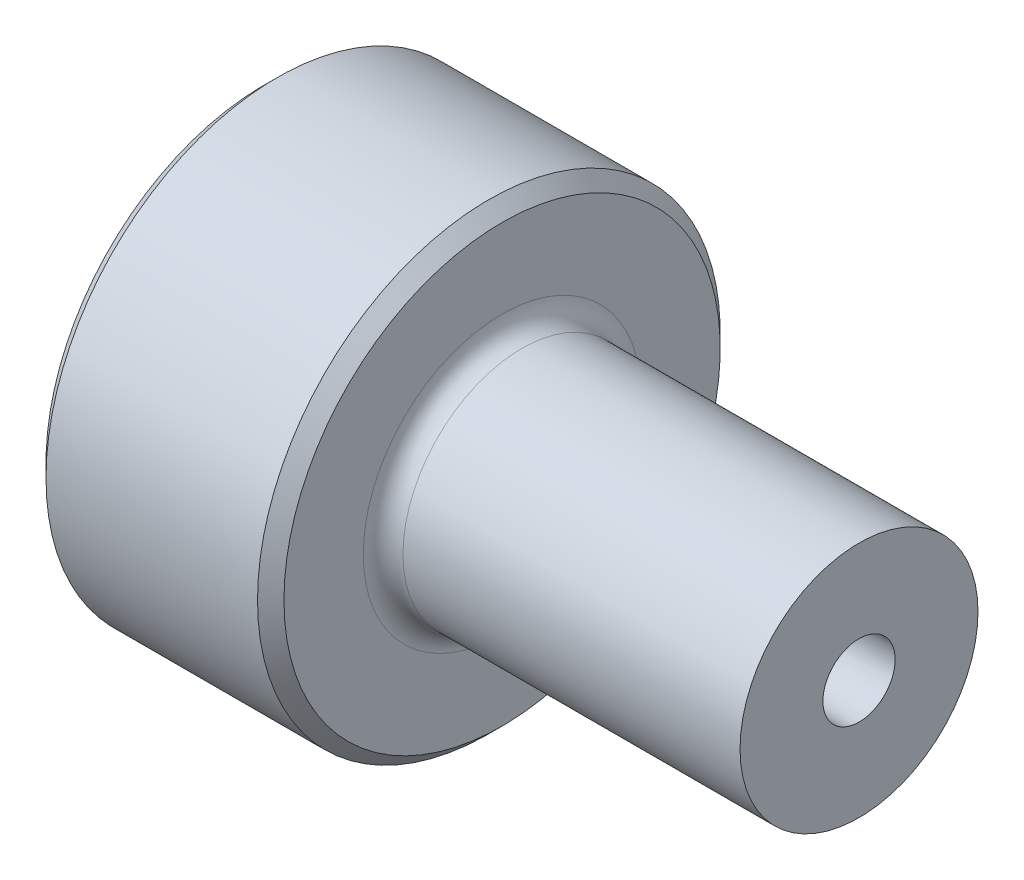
ISO-10303-21;
HEADER;
FILE_DESCRIPTION(('STEP AP214'),'2;1');
FILE_NAME('part.step','',(''),(''),'','','');
FILE_SCHEMA(('AUTOMOTIVE_DESIGN { 1 0 10303 214 1 1 1 1 }'));
ENDSEC;
DATA;
#1=APPLICATION_CONTEXT('core data for automotive mechanical design processes');
#2=APPLICATION_PROTOCOL_DEFINITION('international standard','automotive_design',2000,#1);
#3=PRODUCT_CONTEXT('',#1,'mechanical');
#4=PRODUCT('Part','Part','',(#3));
#5=PRODUCT_RELATED_PRODUCT_CATEGORY('part','',(#4));
#6=PRODUCT_DEFINITION_FORMATION('','',#4);
#7=PRODUCT_DEFINITION_CONTEXT('part definition',#1,'design');
#8=PRODUCT_DEFINITION('design','',#6,#7);
#9=PRODUCT_DEFINITION_SHAPE('','',#8);
#10=(LENGTH_UNIT() NAMED_UNIT(*) SI_UNIT(.MILLI.,.METRE.));
#11=(NAMED_UNIT(*) PLANE_ANGLE_UNIT() SI_UNIT($,.RADIAN.));
#12=(NAMED_UNIT(*) SI_UNIT($,.STERADIAN.) SOLID_ANGLE_UNIT());
#13=UNCERTAINTY_MEASURE_WITH_UNIT(LENGTH_MEASURE(1.E-05),#10,'distance_accuracy_value','');
#14=(GEOMETRIC_REPRESENTATION_CONTEXT(3) GLOBAL_UNCERTAINTY_ASSIGNED_CONTEXT((#13)) GLOBAL_UNIT_ASSIGNED_CONTEXT((#10,
#11,#12)) REPRESENTATION_CONTEXT('',''));
#15=CARTESIAN_POINT('',(0.,0.,0.));
#16=DIRECTION('',(0.,0.,1.));
#17=DIRECTION('',(1.,0.,0.));
#18=AXIS2_PLACEMENT_3D('',#15,#16,#17);
#19=CARTESIAN_POINT('',(0.,4.10062261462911,0.));
#20=DIRECTION('',(1.,0.,0.));
#21=DIRECTION('',(0.,0.,-1.));
#22=AXIS2_PLACEMENT_3D('',#19,#20,#21);
#23=PLANE('',#22);
#24=CARTESIAN_POINT('',(0.,0.,0.));
#25=DIRECTION('',(1.,0.,0.));
#26=DIRECTION('',(0.,0.,-1.));
#27=AXIS2_PLACEMENT_3D('',#24,#25,#26);
#28=CIRCLE('',#27,16.5);
#29=CARTESIAN_POINT('',(0.,0.,-16.5));
#30=VERTEX_POINT('',#29);
#31=EDGE_CURVE('E9',#30,#30,#28,.F.);
#32=ORIENTED_EDGE('',*,*,#31,.T.);
#33=EDGE_LOOP('',(#32));
#34=FACE_BOUND('',#33,.T.);
#35=CARTESIAN_POINT('',(0.,0.,0.));
#36=DIRECTION('',(-1.,0.,0.));
#37=DIRECTION('',(0.,0.,1.));
#38=AXIS2_PLACEMENT_3D('',#35,#36,#37);
#39=CIRCLE('',#38,4.10062261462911);
#40=CARTESIAN_POINT('',(0.,0.,4.10062261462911));
#41=VERTEX_POINT('',#40);
#42=EDGE_CURVE('E49',#41,#41,#39,.T.);
#43=ORIENTED_EDGE('',*,*,#42,.F.);
#44=EDGE_LOOP('',(#43));
#45=FACE_BOUND('',#44,.T.);
#46=ADVANCED_FACE('F14',(#34,#45),#23,.F.);
#47=CARTESIAN_POINT('',(0.,0.,0.));
#48=DIRECTION('',(-1.,0.,0.));
#49=DIRECTION('',(0.,0.,1.));
#50=AXIS2_PLACEMENT_3D('',#47,#48,#49);
#51=CYLINDRICAL_SURFACE('',#50,17.5);
#52=CARTESIAN_POINT('',(17.,0.,0.));
#53=DIRECTION('',(-1.,0.,0.));
#54=DIRECTION('',(0.,0.,1.));
#55=AXIS2_PLACEMENT_3D('',#52,#53,#54);
#56=CIRCLE('',#55,17.5);
#57=CARTESIAN_POINT('',(17.,0.,17.5));
#58=VERTEX_POINT('',#57);
#59=EDGE_CURVE('E25',#58,#58,#56,.T.);
#60=ORIENTED_EDGE('',*,*,#59,.T.);
#61=EDGE_LOOP('',(#60));
#62=FACE_BOUND('',#61,.T.);
#63=CARTESIAN_POINT('',(1.00000000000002,0.,0.));
#64=DIRECTION('',(1.,0.,0.));
#65=DIRECTION('',(0.,0.,-1.));
#66=AXIS2_PLACEMENT_3D('',#63,#64,#65);
#67=CIRCLE('',#66,17.5);
#68=CARTESIAN_POINT('',(1.00000000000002,0.,-17.5));
#69=VERTEX_POINT('',#68);
#70=EDGE_CURVE('E29',#69,#69,#67,.T.);
#71=ORIENTED_EDGE('',*,*,#70,.T.);
#72=EDGE_LOOP('',(#71));
#73=FACE_BOUND('',#72,.T.);
#74=ADVANCED_FACE('F56',(#62,#73),#51,.T.);
#75=CARTESIAN_POINT('',(18.,17.5,0.));
#76=DIRECTION('',(-1.,0.,0.));
#77=DIRECTION('',(0.,0.,1.));
#78=AXIS2_PLACEMENT_3D('',#75,#76,#77);
#79=PLANE('',#78);
#80=CARTESIAN_POINT('',(18.,0.,0.));
#81=DIRECTION('',(-1.,0.,0.));
#82=DIRECTION('',(0.,0.,1.));
#83=AXIS2_PLACEMENT_3D('',#80,#81,#82);
#84=CIRCLE('',#83,16.5);
#85=CARTESIAN_POINT('',(18.,0.,16.5));
#86=VERTEX_POINT('',#85);
#87=EDGE_CURVE('E21',#86,#86,#84,.F.);
#88=ORIENTED_EDGE('',*,*,#87,.T.);
#89=EDGE_LOOP('',(#88));
#90=FACE_BOUND('',#89,.T.);
#91=CARTESIAN_POINT('',(18.,0.,0.));
#92=DIRECTION('',(-1.,0.,0.));
#93=DIRECTION('',(0.,0.,1.));
#94=AXIS2_PLACEMENT_3D('',#91,#92,#93);
#95=CIRCLE('',#94,10.5);
#96=CARTESIAN_POINT('',(18.,0.,10.5));
#97=VERTEX_POINT('',#96);
#98=EDGE_CURVE('E34',#97,#97,#95,.T.);
#99=ORIENTED_EDGE('',*,*,#98,.T.);
#100=EDGE_LOOP('',(#99));
#101=FACE_BOUND('',#100,.T.);
#102=ADVANCED_FACE('F63',(#90,#101),#79,.F.);
#103=CARTESIAN_POINT('',(19.5,0.,0.));
#104=DIRECTION('',(-1.,0.,0.));
#105=DIRECTION('',(0.,0.,1.));
#106=AXIS2_PLACEMENT_3D('',#103,#104,#105);
#107=TOROIDAL_SURFACE('',#106,10.5,1.5);
#108=ORIENTED_EDGE('',*,*,#98,.F.);
#109=EDGE_LOOP('',(#108));
#110=FACE_BOUND('',#109,.T.);
#111=CARTESIAN_POINT('',(19.5,0.,0.));
#112=DIRECTION('',(-1.,0.,0.));
#113=DIRECTION('',(0.,0.,1.));
#114=AXIS2_PLACEMENT_3D('',#111,#112,#113);
#115=CIRCLE('',#114,9.);
#116=CARTESIAN_POINT('',(19.5,0.,9.));
#117=VERTEX_POINT('',#116);
#118=EDGE_CURVE('E37',#117,#117,#115,.T.);
#119=ORIENTED_EDGE('',*,*,#118,.T.);
#120=EDGE_LOOP('',(#119));
#121=FACE_BOUND('',#120,.T.);
#122=ADVANCED_FACE('F99',(#110,#121),#107,.F.);
#123=CARTESIAN_POINT('',(0.,0.,0.));
#124=DIRECTION('',(-1.,0.,0.));
#125=DIRECTION('',(0.,0.,1.));
#126=AXIS2_PLACEMENT_3D('',#123,#124,#125);
#127=CYLINDRICAL_SURFACE('',#126,9.);
#128=ORIENTED_EDGE('',*,*,#118,.F.);
#129=EDGE_LOOP('',(#128));
#130=FACE_BOUND('',#129,.T.);
#131=CARTESIAN_POINT('',(45.,0.,0.));
#132=DIRECTION('',(-1.,0.,0.));
#133=DIRECTION('',(0.,0.,1.));
#134=AXIS2_PLACEMENT_3D('',#131,#132,#133);
#135=CIRCLE('',#134,9.);
#136=CARTESIAN_POINT('',(45.,0.,9.));
#137=VERTEX_POINT('',#136);
#138=EDGE_CURVE('E40',#137,#137,#135,.T.);
#139=ORIENTED_EDGE('',*,*,#138,.T.);
#140=EDGE_LOOP('',(#139));
#141=FACE_BOUND('',#140,.T.);
#142=ADVANCED_FACE('F95',(#130,#141),#127,.T.);
#143=CARTESIAN_POINT('',(45.,2.73311272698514,0.));
#144=DIRECTION('',(-1.,0.,0.));
#145=DIRECTION('',(0.,0.,1.));
#146=AXIS2_PLACEMENT_3D('',#143,#144,#145);
#147=PLANE('',#146);
#148=ORIENTED_EDGE('',*,*,#138,.F.);
#149=EDGE_LOOP('',(#148));
#150=FACE_BOUND('',#149,.T.);
#151=CARTESIAN_POINT('',(45.,0.,0.));
#152=DIRECTION('',(-1.,0.,0.));
#153=DIRECTION('',(0.,0.,1.));
#154=AXIS2_PLACEMENT_3D('',#151,#152,#153);
#155=CIRCLE('',#154,2.73311272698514);
#156=CARTESIAN_POINT('',(45.,0.,2.73311272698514));
#157=VERTEX_POINT('',#156);
#158=EDGE_CURVE('E43',#157,#157,#155,.T.);
#159=ORIENTED_EDGE('',*,*,#158,.T.);
#160=EDGE_LOOP('',(#159));
#161=FACE_BOUND('',#160,.T.);
#162=ADVANCED_FACE('F88',(#150,#161),#147,.F.);
#163=CARTESIAN_POINT('',(3.,0.,0.));
#164=DIRECTION('',(1.,0.,0.));
#165=DIRECTION('',(0.,0.,-1.));
#166=AXIS2_PLACEMENT_3D('',#163,#164,#165);
#167=CONICAL_SURFACE('',#166,2.,0.0174532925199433);
#168=ORIENTED_EDGE('',*,*,#158,.F.);
#169=EDGE_LOOP('',(#168));
#170=FACE_BOUND('',#169,.T.);
#171=CARTESIAN_POINT('',(3.,0.,0.));
#172=DIRECTION('',(-1.,0.,0.));
#173=DIRECTION('',(0.,0.,1.));
#174=AXIS2_PLACEMENT_3D('',#171,#172,#173);
#175=CIRCLE('',#174,2.);
#176=CARTESIAN_POINT('',(3.,0.,2.));
#177=VERTEX_POINT('',#176);
#178=EDGE_CURVE('E46',#177,#177,#175,.T.);
#179=ORIENTED_EDGE('',*,*,#178,.T.);
#180=EDGE_LOOP('',(#179));
#181=FACE_BOUND('',#180,.T.);
#182=ADVANCED_FACE('F76',(#170,#181),#167,.F.);
#183=CARTESIAN_POINT('',(0.,0.,0.));
#184=DIRECTION('',(-1.,0.,0.));
#185=DIRECTION('',(0.,0.,1.));
#186=AXIS2_PLACEMENT_3D('',#183,#184,#185);
#187=CONICAL_SURFACE('',#186,4.10062261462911,0.61086523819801);
#188=ORIENTED_EDGE('',*,*,#178,.F.);
#189=EDGE_LOOP('',(#188));
#190=FACE_BOUND('',#189,.T.);
#191=ORIENTED_EDGE('',*,*,#42,.T.);
#192=EDGE_LOOP('',(#191));
#193=FACE_BOUND('',#192,.T.);
#194=ADVANCED_FACE('F53',(#190,#193),#187,.F.);
#195=CARTESIAN_POINT('',(17.,0.,0.));
#196=DIRECTION('',(-1.,0.,0.));
#197=DIRECTION('',(0.,0.,1.));
#198=AXIS2_PLACEMENT_3D('',#195,#196,#197);
#199=CONICAL_SURFACE('',#198,17.5,0.785398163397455);
#200=ORIENTED_EDGE('',*,*,#87,.F.);
#201=EDGE_LOOP('',(#200));
#202=FACE_BOUND('',#201,.T.);
#203=ORIENTED_EDGE('',*,*,#59,.F.);
#204=EDGE_LOOP('',(#203));
#205=FACE_BOUND('',#204,.T.);
#206=ADVANCED_FACE('F67',(#202,#205),#199,.T.);
#207=CARTESIAN_POINT('',(0.,0.,0.));
#208=DIRECTION('',(1.,0.,0.));
#209=DIRECTION('',(0.,0.,-1.));
#210=AXIS2_PLACEMENT_3D('',#207,#208,#209);
#211=CONICAL_SURFACE('',#210,16.5,0.785398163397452);
#212=ORIENTED_EDGE('',*,*,#70,.F.);
#213=EDGE_LOOP('',(#212));
#214=FACE_BOUND('',#213,.T.);
#215=ORIENTED_EDGE('',*,*,#31,.F.);
#216=EDGE_LOOP('',(#215));
#217=FACE_BOUND('',#216,.T.);
#218=ADVANCED_FACE('F16',(#214,#217),#211,.T.);
#219=CLOSED_SHELL('',(#46,#74,#102,#122,#142,#162,#182,#194,#206,#218));
#220=MANIFOLD_SOLID_BREP('B1',#219);
#221=ADVANCED_BREP_SHAPE_REPRESENTATION('',(#18,#220),#14);
#222=SHAPE_DEFINITION_REPRESENTATION(#9,#221);
ENDSEC;
END-ISO-10303-21;
